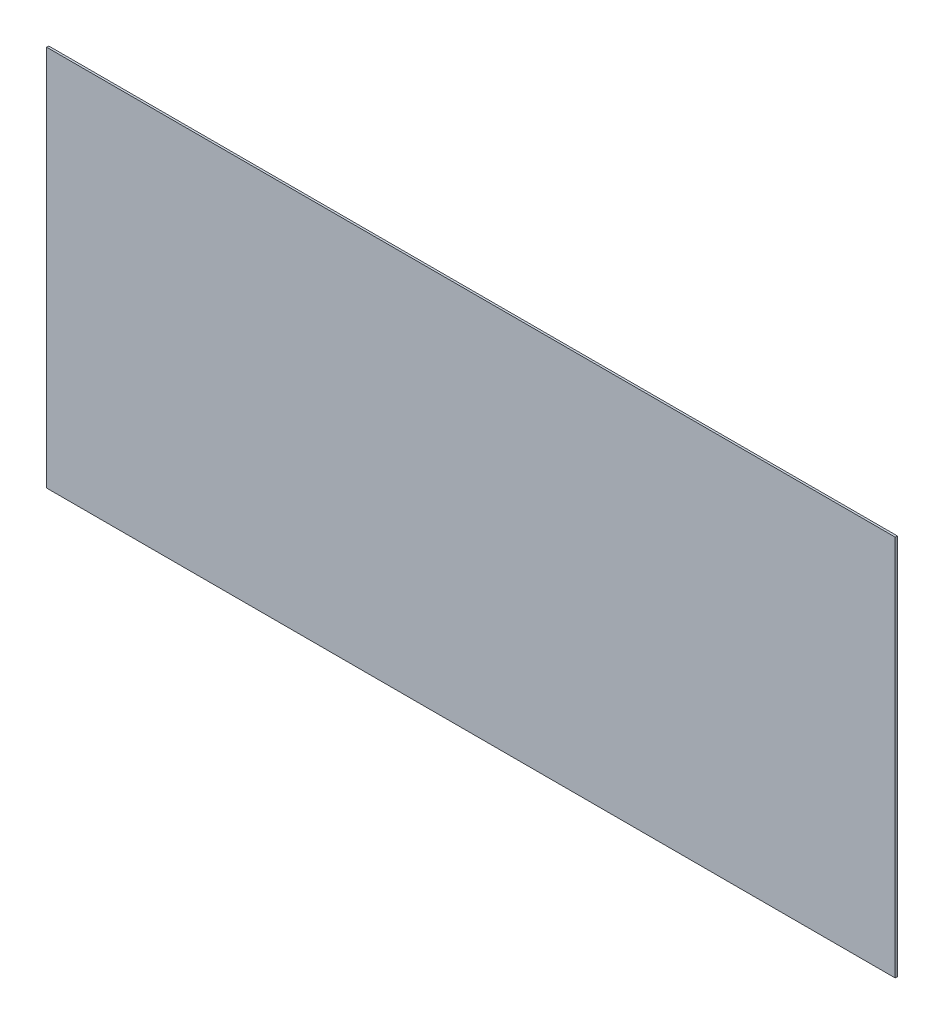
ISO-10303-21;
HEADER;
FILE_DESCRIPTION(('STEP AP214'),'2;1');
FILE_NAME('part.step','',(''),(''),'','','');
FILE_SCHEMA(('AUTOMOTIVE_DESIGN { 1 0 10303 214 1 1 1 1 }'));
ENDSEC;
DATA;
#1=APPLICATION_CONTEXT('core data for automotive mechanical design processes');
#2=APPLICATION_PROTOCOL_DEFINITION('international standard','automotive_design',2000,#1);
#3=PRODUCT_CONTEXT('',#1,'mechanical');
#4=PRODUCT('Part','Part','',(#3));
#5=PRODUCT_RELATED_PRODUCT_CATEGORY('part','',(#4));
#6=PRODUCT_DEFINITION_FORMATION('','',#4);
#7=PRODUCT_DEFINITION_CONTEXT('part definition',#1,'design');
#8=PRODUCT_DEFINITION('design','',#6,#7);
#9=PRODUCT_DEFINITION_SHAPE('','',#8);
#10=(LENGTH_UNIT() NAMED_UNIT(*) SI_UNIT(.MILLI.,.METRE.));
#11=(NAMED_UNIT(*) PLANE_ANGLE_UNIT() SI_UNIT($,.RADIAN.));
#12=(NAMED_UNIT(*) SI_UNIT($,.STERADIAN.) SOLID_ANGLE_UNIT());
#13=UNCERTAINTY_MEASURE_WITH_UNIT(LENGTH_MEASURE(1.E-05),#10,'distance_accuracy_value','');
#14=(GEOMETRIC_REPRESENTATION_CONTEXT(3) GLOBAL_UNCERTAINTY_ASSIGNED_CONTEXT((#13)) GLOBAL_UNIT_ASSIGNED_CONTEXT((#10,
#11,#12)) REPRESENTATION_CONTEXT('',''));
#15=CARTESIAN_POINT('',(0.,0.,0.));
#16=DIRECTION('',(0.,0.,1.));
#17=DIRECTION('',(1.,0.,0.));
#18=AXIS2_PLACEMENT_3D('',#15,#16,#17);
#19=CARTESIAN_POINT('',(0.,0.,5.));
#20=DIRECTION('',(1.,0.,0.));
#21=DIRECTION('',(0.,0.,-1.));
#22=AXIS2_PLACEMENT_3D('',#19,#20,#21);
#23=PLANE('',#22);
#24=DIRECTION('',(0.,-1.,0.));
#25=VECTOR('',#24,1.);
#26=CARTESIAN_POINT('',(0.,0.,0.));
#27=LINE('',#26,#25);
#28=CARTESIAN_POINT('',(0.,900.,0.));
#29=VERTEX_POINT('',#28);
#30=CARTESIAN_POINT('',(0.,0.,0.));
#31=VERTEX_POINT('',#30);
#32=EDGE_CURVE('E94',#29,#31,#27,.T.);
#33=ORIENTED_EDGE('',*,*,#32,.T.);
#34=DIRECTION('',(0.,0.,-1.));
#35=VECTOR('',#34,1.);
#36=CARTESIAN_POINT('',(0.,0.,5.));
#37=LINE('',#36,#35);
#38=CARTESIAN_POINT('',(0.,0.,5.));
#39=VERTEX_POINT('',#38);
#40=EDGE_CURVE('E11',#39,#31,#37,.T.);
#41=ORIENTED_EDGE('',*,*,#40,.F.);
#42=DIRECTION('',(0.,-1.,0.));
#43=VECTOR('',#42,1.);
#44=CARTESIAN_POINT('',(0.,0.,5.));
#45=LINE('',#44,#43);
#46=CARTESIAN_POINT('',(0.,900.,5.));
#47=VERTEX_POINT('',#46);
#48=EDGE_CURVE('E82',#47,#39,#45,.T.);
#49=ORIENTED_EDGE('',*,*,#48,.F.);
#50=DIRECTION('',(0.,0.,-1.));
#51=VECTOR('',#50,1.);
#52=CARTESIAN_POINT('',(0.,900.,5.));
#53=LINE('',#52,#51);
#54=EDGE_CURVE('E90',#47,#29,#53,.T.);
#55=ORIENTED_EDGE('',*,*,#54,.T.);
#56=EDGE_LOOP('',(#33,#41,#49,#55));
#57=FACE_BOUND('',#56,.T.);
#58=ADVANCED_FACE('F31',(#57),#23,.F.);
#59=CARTESIAN_POINT('',(0.,0.,5.));
#60=DIRECTION('',(0.,1.,0.));
#61=DIRECTION('',(0.,0.,1.));
#62=AXIS2_PLACEMENT_3D('',#59,#60,#61);
#63=PLANE('',#62);
#64=DIRECTION('',(1.,0.,0.));
#65=VECTOR('',#64,1.);
#66=CARTESIAN_POINT('',(0.,0.,0.));
#67=LINE('',#66,#65);
#68=CARTESIAN_POINT('',(2000.,0.,0.));
#69=VERTEX_POINT('',#68);
#70=EDGE_CURVE('E86',#31,#69,#67,.T.);
#71=ORIENTED_EDGE('',*,*,#70,.T.);
#72=DIRECTION('',(0.,0.,-1.));
#73=VECTOR('',#72,1.);
#74=CARTESIAN_POINT('',(2000.,0.,5.));
#75=LINE('',#74,#73);
#76=CARTESIAN_POINT('',(2000.,0.,5.));
#77=VERTEX_POINT('',#76);
#78=EDGE_CURVE('E39',#77,#69,#75,.T.);
#79=ORIENTED_EDGE('',*,*,#78,.F.);
#80=DIRECTION('',(1.,0.,0.));
#81=VECTOR('',#80,1.);
#82=CARTESIAN_POINT('',(0.,0.,5.));
#83=LINE('',#82,#81);
#84=EDGE_CURVE('E77',#39,#77,#83,.T.);
#85=ORIENTED_EDGE('',*,*,#84,.F.);
#86=ORIENTED_EDGE('',*,*,#40,.T.);
#87=EDGE_LOOP('',(#71,#79,#85,#86));
#88=FACE_BOUND('',#87,.T.);
#89=ADVANCED_FACE('F85',(#88),#63,.F.);
#90=CARTESIAN_POINT('',(2000.,0.,5.));
#91=DIRECTION('',(-1.,0.,0.));
#92=DIRECTION('',(0.,0.,1.));
#93=AXIS2_PLACEMENT_3D('',#90,#91,#92);
#94=PLANE('',#93);
#95=DIRECTION('',(0.,1.,0.));
#96=VECTOR('',#95,1.);
#97=CARTESIAN_POINT('',(2000.,0.,0.));
#98=LINE('',#97,#96);
#99=CARTESIAN_POINT('',(2000.,900.,0.));
#100=VERTEX_POINT('',#99);
#101=EDGE_CURVE('E64',#69,#100,#98,.T.);
#102=ORIENTED_EDGE('',*,*,#101,.T.);
#103=DIRECTION('',(0.,0.,-1.));
#104=VECTOR('',#103,1.);
#105=CARTESIAN_POINT('',(2000.,900.,5.));
#106=LINE('',#105,#104);
#107=CARTESIAN_POINT('',(2000.,900.,5.));
#108=VERTEX_POINT('',#107);
#109=EDGE_CURVE('E87',#108,#100,#106,.T.);
#110=ORIENTED_EDGE('',*,*,#109,.F.);
#111=DIRECTION('',(0.,1.,0.));
#112=VECTOR('',#111,1.);
#113=CARTESIAN_POINT('',(2000.,0.,5.));
#114=LINE('',#113,#112);
#115=EDGE_CURVE('E80',#77,#108,#114,.T.);
#116=ORIENTED_EDGE('',*,*,#115,.F.);
#117=ORIENTED_EDGE('',*,*,#78,.T.);
#118=EDGE_LOOP('',(#102,#110,#116,#117));
#119=FACE_BOUND('',#118,.T.);
#120=ADVANCED_FACE('F88',(#119),#94,.F.);
#121=CARTESIAN_POINT('',(0.,900.,5.));
#122=DIRECTION('',(0.,-1.,0.));
#123=DIRECTION('',(0.,0.,-1.));
#124=AXIS2_PLACEMENT_3D('',#121,#122,#123);
#125=PLANE('',#124);
#126=DIRECTION('',(-1.,0.,0.));
#127=VECTOR('',#126,1.);
#128=CARTESIAN_POINT('',(0.,900.,0.));
#129=LINE('',#128,#127);
#130=EDGE_CURVE('E70',#100,#29,#129,.T.);
#131=ORIENTED_EDGE('',*,*,#130,.T.);
#132=ORIENTED_EDGE('',*,*,#54,.F.);
#133=DIRECTION('',(-1.,0.,0.));
#134=VECTOR('',#133,1.);
#135=CARTESIAN_POINT('',(0.,900.,5.));
#136=LINE('',#135,#134);
#137=EDGE_CURVE('E47',#108,#47,#136,.T.);
#138=ORIENTED_EDGE('',*,*,#137,.F.);
#139=ORIENTED_EDGE('',*,*,#109,.T.);
#140=EDGE_LOOP('',(#131,#132,#138,#139));
#141=FACE_BOUND('',#140,.T.);
#142=ADVANCED_FACE('F101',(#141),#125,.F.);
#143=CARTESIAN_POINT('',(0.,900.,5.));
#144=DIRECTION('',(0.,0.,-1.));
#145=DIRECTION('',(-1.,0.,0.));
#146=AXIS2_PLACEMENT_3D('',#143,#144,#145);
#147=PLANE('',#146);
#148=ORIENTED_EDGE('',*,*,#48,.T.);
#149=ORIENTED_EDGE('',*,*,#84,.T.);
#150=ORIENTED_EDGE('',*,*,#115,.T.);
#151=ORIENTED_EDGE('',*,*,#137,.T.);
#152=EDGE_LOOP('',(#148,#149,#150,#151));
#153=FACE_BOUND('',#152,.T.);
#154=ADVANCED_FACE('F78',(#153),#147,.F.);
#155=CARTESIAN_POINT('',(0.,900.,0.));
#156=DIRECTION('',(0.,0.,-1.));
#157=DIRECTION('',(-1.,0.,0.));
#158=AXIS2_PLACEMENT_3D('',#155,#156,#157);
#159=PLANE('',#158);
#160=ORIENTED_EDGE('',*,*,#32,.F.);
#161=ORIENTED_EDGE('',*,*,#130,.F.);
#162=ORIENTED_EDGE('',*,*,#101,.F.);
#163=ORIENTED_EDGE('',*,*,#70,.F.);
#164=EDGE_LOOP('',(#160,#161,#162,#163));
#165=FACE_BOUND('',#164,.T.);
#166=ADVANCED_FACE('F104',(#165),#159,.T.);
#167=CLOSED_SHELL('',(#58,#89,#120,#142,#154,#166));
#168=MANIFOLD_SOLID_BREP('B2',#167);
#169=ADVANCED_BREP_SHAPE_REPRESENTATION('',(#18,#168),#14);
#170=SHAPE_DEFINITION_REPRESENTATION(#9,#169);
ENDSEC;
END-ISO-10303-21;
